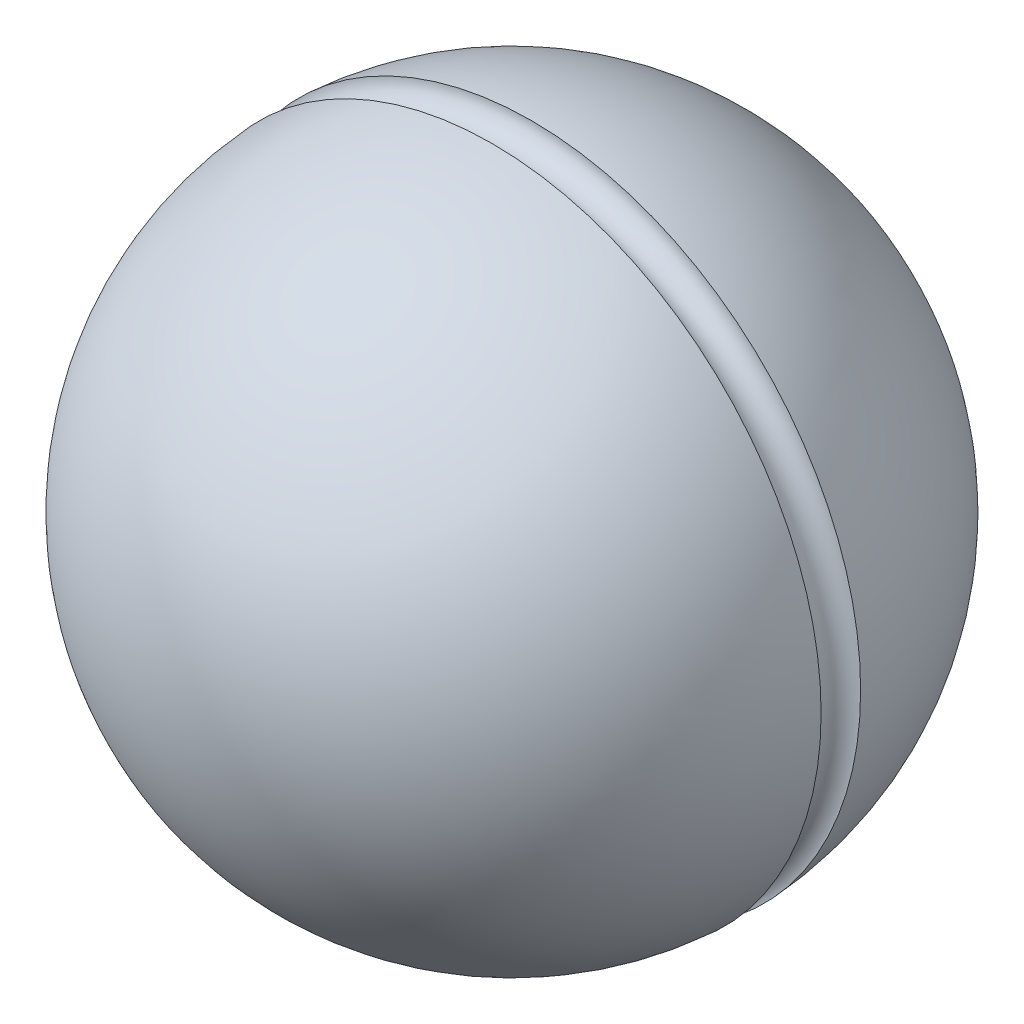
ISO-10303-21;
HEADER;
FILE_DESCRIPTION(('STEP AP214'),'2;1');
FILE_NAME('part.step','',(''),(''),'','','');
FILE_SCHEMA(('AUTOMOTIVE_DESIGN { 1 0 10303 214 1 1 1 1 }'));
ENDSEC;
DATA;
#1=APPLICATION_CONTEXT('core data for automotive mechanical design processes');
#2=APPLICATION_PROTOCOL_DEFINITION('international standard','automotive_design',2000,#1);
#3=PRODUCT_CONTEXT('',#1,'mechanical');
#4=PRODUCT('Part','Part','',(#3));
#5=PRODUCT_RELATED_PRODUCT_CATEGORY('part','',(#4));
#6=PRODUCT_DEFINITION_FORMATION('','',#4);
#7=PRODUCT_DEFINITION_CONTEXT('part definition',#1,'design');
#8=PRODUCT_DEFINITION('design','',#6,#7);
#9=PRODUCT_DEFINITION_SHAPE('','',#8);
#10=(LENGTH_UNIT() NAMED_UNIT(*) SI_UNIT(.MILLI.,.METRE.));
#11=(NAMED_UNIT(*) PLANE_ANGLE_UNIT() SI_UNIT($,.RADIAN.));
#12=(NAMED_UNIT(*) SI_UNIT($,.STERADIAN.) SOLID_ANGLE_UNIT());
#13=UNCERTAINTY_MEASURE_WITH_UNIT(LENGTH_MEASURE(1.E-05),#10,'distance_accuracy_value','');
#14=(GEOMETRIC_REPRESENTATION_CONTEXT(3) GLOBAL_UNCERTAINTY_ASSIGNED_CONTEXT((#13)) GLOBAL_UNIT_ASSIGNED_CONTEXT((#10,
#11,#12)) REPRESENTATION_CONTEXT('',''));
#15=CARTESIAN_POINT('',(0.,0.,0.));
#16=DIRECTION('',(0.,0.,1.));
#17=DIRECTION('',(1.,0.,0.));
#18=AXIS2_PLACEMENT_3D('',#15,#16,#17);
#19=CARTESIAN_POINT('',(0.,13.5646599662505,0.));
#20=DIRECTION('',(0.,0.,-1.));
#21=DIRECTION('',(-1.,0.,0.));
#22=AXIS2_PLACEMENT_3D('',#19,#20,#21);
#23=PLANE('',#22);
#24=CARTESIAN_POINT('',(0.,0.,0.));
#25=DIRECTION('',(0.,0.,-1.));
#26=DIRECTION('',(-1.,0.,0.));
#27=AXIS2_PLACEMENT_3D('',#24,#25,#26);
#28=CIRCLE('',#27,13.5646599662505);
#29=CARTESIAN_POINT('',(0.,13.5646599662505,0.));
#30=VERTEX_POINT('',#29);
#31=EDGE_CURVE('E23',#30,#30,#28,.T.);
#32=ORIENTED_EDGE('',*,*,#31,.T.);
#33=EDGE_LOOP('',(#32));
#34=FACE_BOUND('',#33,.T.);
#35=CARTESIAN_POINT('',(0.,0.,0.));
#36=DIRECTION('',(0.,0.,1.));
#37=DIRECTION('',(1.,0.,0.));
#38=AXIS2_PLACEMENT_3D('',#35,#36,#37);
#39=CIRCLE('',#38,8.);
#40=CARTESIAN_POINT('',(8.,0.,0.));
#41=VERTEX_POINT('',#40);
#42=EDGE_CURVE('E32',#41,#41,#39,.T.);
#43=ORIENTED_EDGE('',*,*,#42,.T.);
#44=EDGE_LOOP('',(#43));
#45=FACE_BOUND('',#44,.T.);
#46=ADVANCED_FACE('F12',(#34,#45),#23,.T.);
#47=CARTESIAN_POINT('',(0.,0.,21.));
#48=DIRECTION('',(0.,0.,-1.));
#49=DIRECTION('',(0.,1.,0.));
#50=AXIS2_PLACEMENT_3D('',#47,#48,#49);
#51=SPHERICAL_SURFACE('',#50,25.);
#52=CARTESIAN_POINT('',(0.,0.,19.5006751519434));
#53=DIRECTION('',(0.,0.,-1.));
#54=DIRECTION('',(-1.,0.,0.));
#55=AXIS2_PLACEMENT_3D('',#52,#53,#54);
#56=CIRCLE('',#55,24.955);
#57=CARTESIAN_POINT('',(0.,24.955,19.5006751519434));
#58=VERTEX_POINT('',#57);
#59=EDGE_CURVE('E8',#58,#58,#56,.T.);
#60=CARTESIAN_POINT('',(0.,24.955,19.5006751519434));
#61=CARTESIAN_POINT('',(0.,24.9403627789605,19.2570325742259));
#62=CARTESIAN_POINT('',(0.,24.9221552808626,19.0136045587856));
#63=CARTESIAN_POINT('',(0.,24.87862016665,18.5273860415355));
#64=CARTESIAN_POINT('',(0.,24.8532925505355,18.2845955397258));
#65=CARTESIAN_POINT('',(0.,24.79553763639,17.7998604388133));
#66=CARTESIAN_POINT('',(0.,24.763110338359,17.5579158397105));
#67=CARTESIAN_POINT('',(0.,24.6911842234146,17.0750800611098));
#68=CARTESIAN_POINT('',(0.,24.6516854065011,16.8341888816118));
#69=CARTESIAN_POINT('',(0.,24.5656500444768,16.3536665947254));
#70=CARTESIAN_POINT('',(0.,24.5191134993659,16.1140354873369));
#71=CARTESIAN_POINT('',(0.,24.4190426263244,15.636238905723));
#72=CARTESIAN_POINT('',(0.,24.3655082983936,15.3980734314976));
#73=CARTESIAN_POINT('',(0.,24.2514877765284,14.9234124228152));
#74=CARTESIAN_POINT('',(0.,24.1910015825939,14.6869168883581));
#75=CARTESIAN_POINT('',(0.,24.0631292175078,14.2157986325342));
#76=CARTESIAN_POINT('',(0.,23.9957430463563,13.9811759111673));
#77=CARTESIAN_POINT('',(0.,23.8541285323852,13.5140045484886));
#78=CARTESIAN_POINT('',(0.,23.7799001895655,13.2814559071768));
#79=CARTESIAN_POINT('',(0.,23.6246650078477,12.8186321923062));
#80=CARTESIAN_POINT('',(0.,23.5436581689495,12.5883571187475));
#81=CARTESIAN_POINT('',(0.,23.3749354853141,12.130278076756));
#82=CARTESIAN_POINT('',(0.,23.2872196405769,11.9024741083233));
#83=CARTESIAN_POINT('',(0.,23.1051541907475,11.4495326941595));
#84=CARTESIAN_POINT('',(0.,23.0108045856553,11.2243952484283));
#85=CARTESIAN_POINT('',(0.,22.8155525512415,10.7769800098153));
#86=CARTESIAN_POINT('',(0.,22.7146501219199,10.5547022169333));
#87=CARTESIAN_POINT('',(0.,22.5063789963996,10.1131969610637));
#88=CARTESIAN_POINT('',(0.,22.3990103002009,9.89396949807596));
#89=CARTESIAN_POINT('',(0.,22.1778987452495,9.45875296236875));
#90=CARTESIAN_POINT('',(0.,22.0641558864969,9.24276388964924));
#91=CARTESIAN_POINT('',(0.,21.8303935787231,8.81420941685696));
#92=CARTESIAN_POINT('',(0.,21.7103741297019,8.6016440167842));
#93=CARTESIAN_POINT('',(0.,21.4641615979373,8.18011923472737));
#94=CARTESIAN_POINT('',(0.,21.3379685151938,7.9711598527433));
#95=CARTESIAN_POINT('',(0.,21.0795169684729,7.55702635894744));
#96=CARTESIAN_POINT('',(0.,20.9472585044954,7.35185224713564));
#97=CARTESIAN_POINT('',(0.,20.6767896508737,6.94546529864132));
#98=CARTESIAN_POINT('',(0.,20.5385792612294,6.7442524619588));
#99=CARTESIAN_POINT('',(0.,20.256325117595,6.34596067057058));
#100=CARTESIAN_POINT('',(0.,20.1122813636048,6.14888171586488));
#101=CARTESIAN_POINT('',(0.,19.8184840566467,5.7590267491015));
#102=CARTESIAN_POINT('',(0.,19.6687305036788,5.56625073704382));
#103=CARTESIAN_POINT('',(0.,19.3636420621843,5.1851670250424));
#104=CARTESIAN_POINT('',(0.,19.2083071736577,4.99685932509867));
#105=CARTESIAN_POINT('',(0.,18.8921893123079,4.62487377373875));
#106=CARTESIAN_POINT('',(0.,18.7314063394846,4.44119592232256));
#107=CARTESIAN_POINT('',(0.,18.40453023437,4.07862763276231));
#108=CARTESIAN_POINT('',(0.,18.2384371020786,3.89973719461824));
#109=CARTESIAN_POINT('',(0.,17.9010831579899,3.54689718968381));
#110=CARTESIAN_POINT('',(0.,17.7298223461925,3.37294762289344));
#111=CARTESIAN_POINT('',(0.,17.3822799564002,3.03013857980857));
#112=CARTESIAN_POINT('',(0.,17.2059983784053,2.86127910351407));
#113=CARTESIAN_POINT('',(0.,16.8485656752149,2.52879509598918));
#114=CARTESIAN_POINT('',(0.,16.6674145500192,2.36517056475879));
#115=CARTESIAN_POINT('',(0.,16.3003981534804,2.0432968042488));
#116=CARTESIAN_POINT('',(0.,16.1145328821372,1.8850475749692));
#117=CARTESIAN_POINT('',(0.,15.7382476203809,1.5740601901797));
#118=CARTESIAN_POINT('',(0.,15.5478276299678,1.4213220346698));
#119=CARTESIAN_POINT('',(0.,15.1625963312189,1.12148774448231));
#120=CARTESIAN_POINT('',(0.,14.9677850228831,0.974391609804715));
#121=CARTESIAN_POINT('',(0.,14.573938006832,0.685967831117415));
#122=CARTESIAN_POINT('',(0.,14.3749022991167,0.544640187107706));
#123=CARTESIAN_POINT('',(0.,13.9727779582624,0.267873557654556));
#124=CARTESIAN_POINT('',(0.,13.7696893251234,0.132434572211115));
#125=CARTESIAN_POINT('',(0.,13.5646599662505,0.));
#126=B_SPLINE_CURVE_WITH_KNOTS('',3,(#60,#61,#62,#63,#64,#65,#66,#67,#68,#69,#70,#71,#72,#73,
#74,#75,#76,#77,#78,#79,#80,#81,#82,#83,#84,#85,#86,#87,#88,#89,#90,#91,#92,#93,#94,#95,#96,#97,
#98,#99,#100,#101,#102,#103,#104,#105,#106,#107,#108,#109,#110,#111,#112,#113,#114,#115,#116,
#117,#118,#119,#120,#121,#122,#123,#124,#125),.UNSPECIFIED.,.F.,.F.,(4,2,2,2,2,2,2,2,2,2,2,2,2,
2,2,2,2,2,2,2,2,2,2,2,2,2,2,2,2,2,2,2,4),(0.,0.732219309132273,1.46443861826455,
2.19665792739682,2.92887723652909,3.66109654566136,4.39331585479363,5.1255351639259,
5.85775447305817,6.58997378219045,7.32219309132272,8.05441240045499,8.78663170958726,
9.51885101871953,10.2510703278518,10.9832896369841,11.7155089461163,12.4477282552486,
13.1799475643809,13.9121668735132,14.6443861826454,15.3766054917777,16.10882480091,
16.8410441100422,17.5732634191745,18.3054827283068,19.0377020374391,19.7699213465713,
20.5021406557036,21.2343599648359,21.9665792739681,22.6987985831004,23.4310178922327),.UNSPECIFIED.);
#127=EDGE_CURVE('BSEAM14',#58,#30,#126,.T.);
#128=ORIENTED_EDGE('',*,*,#59,.T.);
#129=ORIENTED_EDGE('',*,*,#31,.F.);
#130=ORIENTED_EDGE('',*,*,#127,.T.);
#131=ORIENTED_EDGE('',*,*,#127,.F.);
#132=EDGE_LOOP('',(#128,#130,#129,#131));
#133=FACE_BOUND('',#132,.T.);
#134=ADVANCED_FACE('F14',(#133),#51,.T.);
#135=CARTESIAN_POINT('',(0.,0.,21.));
#136=DIRECTION('',(0.,0.,-1.));
#137=DIRECTION('',(-1.,0.,0.));
#138=AXIS2_PLACEMENT_3D('',#135,#136,#137);
#139=TOROIDAL_SURFACE('',#138,25.,1.5);
#140=CARTESIAN_POINT('',(0.,0.,22.4993248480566));
#141=DIRECTION('',(0.,0.,-1.));
#142=DIRECTION('',(-1.,0.,0.));
#143=AXIS2_PLACEMENT_3D('',#140,#141,#142);
#144=CIRCLE('',#143,24.955);
#145=CARTESIAN_POINT('',(-24.955,0.,22.4993248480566));
#146=VERTEX_POINT('',#145);
#147=EDGE_CURVE('E19',#146,#146,#144,.T.);
#148=ORIENTED_EDGE('',*,*,#147,.T.);
#149=EDGE_LOOP('',(#148));
#150=FACE_BOUND('',#149,.T.);
#151=ORIENTED_EDGE('',*,*,#59,.F.);
#152=EDGE_LOOP('',(#151));
#153=FACE_BOUND('',#152,.T.);
#154=ADVANCED_FACE('F50',(#150,#153),#139,.F.);
#155=CARTESIAN_POINT('',(0.,0.,21.));
#156=DIRECTION('',(0.,0.,-1.));
#157=DIRECTION('',(0.,1.,0.));
#158=AXIS2_PLACEMENT_3D('',#155,#156,#157);
#159=SPHERICAL_SURFACE('',#158,25.);
#160=ORIENTED_EDGE('',*,*,#147,.F.);
#161=EDGE_LOOP('',(#160));
#162=FACE_BOUND('',#161,.T.);
#163=ADVANCED_FACE('F40',(#162),#159,.T.);
#164=CARTESIAN_POINT('',(0.,0.,28.));
#165=DIRECTION('',(0.,0.,-1.));
#166=DIRECTION('',(-1.,0.,0.));
#167=AXIS2_PLACEMENT_3D('',#164,#165,#166);
#168=CYLINDRICAL_SURFACE('',#167,8.);
#169=CARTESIAN_POINT('',(0.,0.,28.));
#170=DIRECTION('',(0.,0.,1.));
#171=DIRECTION('',(1.,0.,0.));
#172=AXIS2_PLACEMENT_3D('',#169,#170,#171);
#173=CIRCLE('',#172,8.);
#174=CARTESIAN_POINT('',(8.,0.,28.));
#175=VERTEX_POINT('',#174);
#176=EDGE_CURVE('E27',#175,#175,#173,.T.);
#177=ORIENTED_EDGE('',*,*,#176,.T.);
#178=EDGE_LOOP('',(#177));
#179=FACE_BOUND('',#178,.T.);
#180=ORIENTED_EDGE('',*,*,#42,.F.);
#181=EDGE_LOOP('',(#180));
#182=FACE_BOUND('',#181,.T.);
#183=ADVANCED_FACE('F37',(#179,#182),#168,.F.);
#184=CARTESIAN_POINT('',(0.,0.,28.));
#185=DIRECTION('',(0.,0.,1.));
#186=DIRECTION('',(1.,0.,0.));
#187=AXIS2_PLACEMENT_3D('',#184,#185,#186);
#188=PLANE('',#187);
#189=ORIENTED_EDGE('',*,*,#176,.F.);
#190=EDGE_LOOP('',(#189));
#191=FACE_BOUND('',#190,.T.);
#192=ADVANCED_FACE('F39',(#191),#188,.F.);
#193=CLOSED_SHELL('',(#46,#134,#154,#163,#183,#192));
#194=MANIFOLD_SOLID_BREP('B1',#193);
#195=ADVANCED_BREP_SHAPE_REPRESENTATION('',(#18,#194),#14);
#196=SHAPE_DEFINITION_REPRESENTATION(#9,#195);
ENDSEC;
END-ISO-10303-21;
